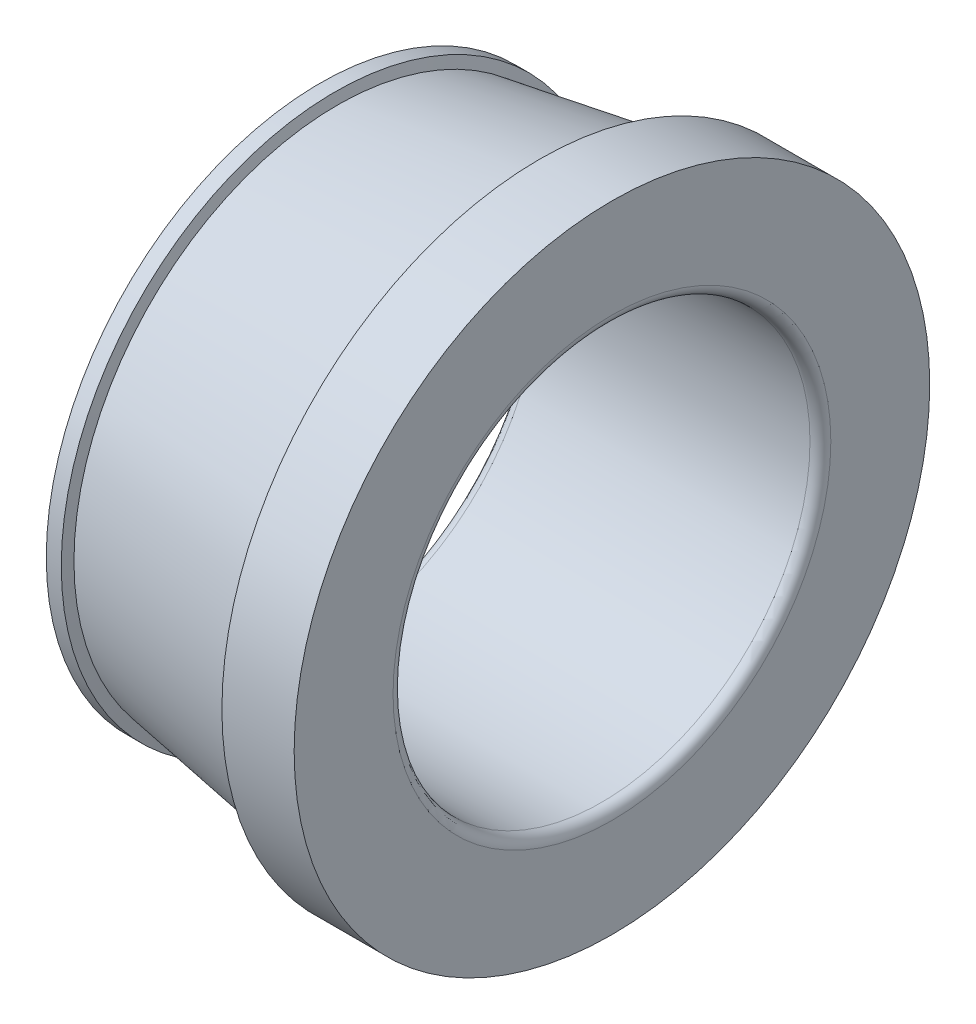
from build123d import *


with BuildPart() as part:
    # Esquisse1 → Base-R_volution (revolve)
    with BuildSketch(Plane(origin=(0, 0, 0), x_dir=(1, 0, 0), z_dir=(0, 1, 0)), mode=Mode.PRIVATE) as base_r_volution_sk:
        with BuildLine():
            Line((14.75, 10), (1.75, 10))
            ThreePointArc((1.75, 10), (1.396446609, 10.146446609), (1.25, 10.5))
            Line((1.25, 10.5), (1.25, 13.134579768))
            Line((1.25, 13.134579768), (1.969436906, 13.134579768))
            Line((1.969436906, 13.134579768), (2.077645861, 12.634579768))
            Line((2.077645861, 12.634579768), (12, 14.243695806))
            Line((12, 14.243695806), (11.78358209, 15.243695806))
            Line((11.78358209, 15.243695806), (15.25, 15.243695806))
            Line((15.25, 15.243695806), (15.25, 10.5))
            ThreePointArc((15.25, 10.5), (15.103553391, 10.146446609), (14.75, 10))
        make_face()
    revolve(base_r_volution_sk.sketch.rotate(Axis((0, 0, 0), (1, 0, 0)), 180), axis=Axis((0, 0, 0), (1, 0, 0)))


solid = part.part
